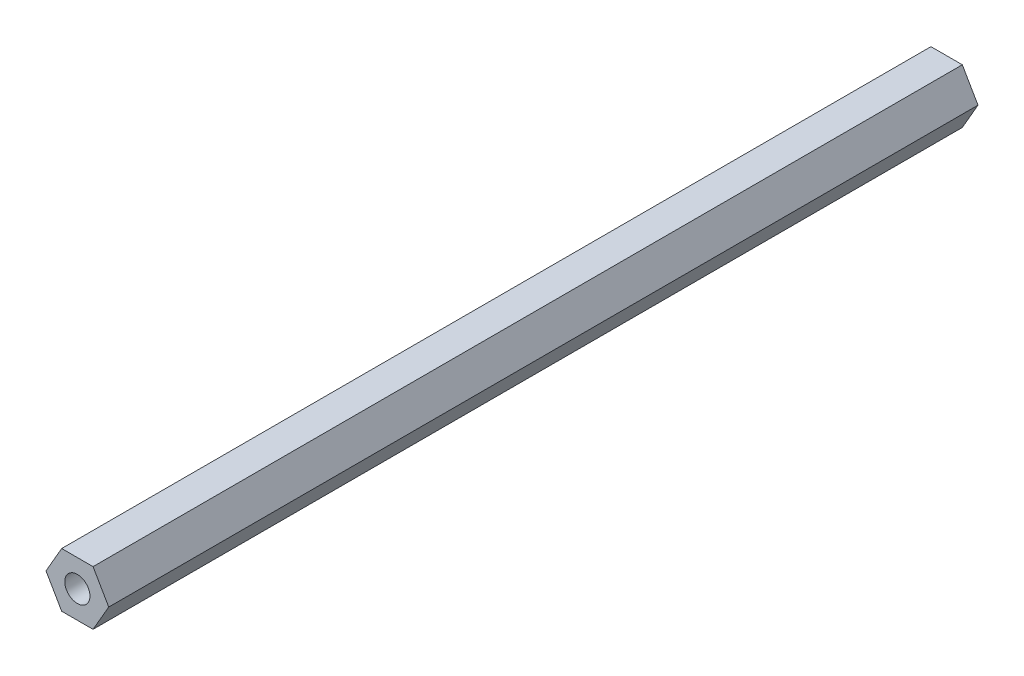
ISO-10303-21;
HEADER;
FILE_DESCRIPTION(('STEP AP214'),'2;1');
FILE_NAME('part.step','',(''),(''),'','','');
FILE_SCHEMA(('AUTOMOTIVE_DESIGN { 1 0 10303 214 1 1 1 1 }'));
ENDSEC;
DATA;
#1=APPLICATION_CONTEXT('core data for automotive mechanical design processes');
#2=APPLICATION_PROTOCOL_DEFINITION('international standard','automotive_design',2000,#1);
#3=PRODUCT_CONTEXT('',#1,'mechanical');
#4=PRODUCT('Part','Part','',(#3));
#5=PRODUCT_RELATED_PRODUCT_CATEGORY('part','',(#4));
#6=PRODUCT_DEFINITION_FORMATION('','',#4);
#7=PRODUCT_DEFINITION_CONTEXT('part definition',#1,'design');
#8=PRODUCT_DEFINITION('design','',#6,#7);
#9=PRODUCT_DEFINITION_SHAPE('','',#8);
#10=(LENGTH_UNIT() NAMED_UNIT(*) SI_UNIT(.MILLI.,.METRE.));
#11=(NAMED_UNIT(*) PLANE_ANGLE_UNIT() SI_UNIT($,.RADIAN.));
#12=(NAMED_UNIT(*) SI_UNIT($,.STERADIAN.) SOLID_ANGLE_UNIT());
#13=UNCERTAINTY_MEASURE_WITH_UNIT(LENGTH_MEASURE(1.E-05),#10,'distance_accuracy_value','');
#14=(GEOMETRIC_REPRESENTATION_CONTEXT(3) GLOBAL_UNCERTAINTY_ASSIGNED_CONTEXT((#13)) GLOBAL_UNIT_ASSIGNED_CONTEXT((#10,
#11,#12)) REPRESENTATION_CONTEXT('',''));
#15=CARTESIAN_POINT('',(0.,0.,0.));
#16=DIRECTION('',(0.,0.,1.));
#17=DIRECTION('',(1.,0.,0.));
#18=AXIS2_PLACEMENT_3D('',#15,#16,#17);
#19=CARTESIAN_POINT('',(3.66617420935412,0.,101.6));
#20=DIRECTION('',(-0.866025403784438,-0.5,0.));
#21=DIRECTION('',(0.5,-0.866025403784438,0.));
#22=AXIS2_PLACEMENT_3D('',#19,#20,#21);
#23=PLANE('',#22);
#24=DIRECTION('',(-0.5,0.866025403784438,0.));
#25=VECTOR('',#24,1.);
#26=CARTESIAN_POINT('',(3.66617420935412,0.,0.));
#27=LINE('',#26,#25);
#28=CARTESIAN_POINT('',(3.66617420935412,0.,0.));
#29=VERTEX_POINT('',#28);
#30=CARTESIAN_POINT('',(1.83308710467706,3.175,0.));
#31=VERTEX_POINT('',#30);
#32=EDGE_CURVE('E117',#29,#31,#27,.T.);
#33=ORIENTED_EDGE('',*,*,#32,.T.);
#34=DIRECTION('',(0.,0.,-1.));
#35=VECTOR('',#34,1.);
#36=CARTESIAN_POINT('',(1.83308710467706,3.175,101.6));
#37=LINE('',#36,#35);
#38=CARTESIAN_POINT('',(1.83308710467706,3.175,101.6));
#39=VERTEX_POINT('',#38);
#40=EDGE_CURVE('E11',#39,#31,#37,.T.);
#41=ORIENTED_EDGE('',*,*,#40,.F.);
#42=DIRECTION('',(-0.5,0.866025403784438,0.));
#43=VECTOR('',#42,1.);
#44=CARTESIAN_POINT('',(3.66617420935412,0.,101.6));
#45=LINE('',#44,#43);
#46=CARTESIAN_POINT('',(3.66617420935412,0.,101.6));
#47=VERTEX_POINT('',#46);
#48=EDGE_CURVE('E128',#47,#39,#45,.T.);
#49=ORIENTED_EDGE('',*,*,#48,.F.);
#50=DIRECTION('',(0.,0.,-1.));
#51=VECTOR('',#50,1.);
#52=CARTESIAN_POINT('',(3.66617420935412,0.,101.6));
#53=LINE('',#52,#51);
#54=EDGE_CURVE('E113',#47,#29,#53,.T.);
#55=ORIENTED_EDGE('',*,*,#54,.T.);
#56=EDGE_LOOP('',(#33,#41,#49,#55));
#57=FACE_BOUND('',#56,.T.);
#58=ADVANCED_FACE('F33',(#57),#23,.F.);
#59=CARTESIAN_POINT('',(1.83308710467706,3.175,101.6));
#60=DIRECTION('',(0.,-1.,0.));
#61=DIRECTION('',(0.,0.,-1.));
#62=AXIS2_PLACEMENT_3D('',#59,#60,#61);
#63=PLANE('',#62);
#64=DIRECTION('',(-1.,0.,0.));
#65=VECTOR('',#64,1.);
#66=CARTESIAN_POINT('',(1.83308710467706,3.175,0.));
#67=LINE('',#66,#65);
#68=CARTESIAN_POINT('',(-1.83308710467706,3.175,0.));
#69=VERTEX_POINT('',#68);
#70=EDGE_CURVE('E120',#31,#69,#67,.T.);
#71=ORIENTED_EDGE('',*,*,#70,.T.);
#72=DIRECTION('',(0.,0.,-1.));
#73=VECTOR('',#72,1.);
#74=CARTESIAN_POINT('',(-1.83308710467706,3.175,101.6));
#75=LINE('',#74,#73);
#76=CARTESIAN_POINT('',(-1.83308710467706,3.175,101.6));
#77=VERTEX_POINT('',#76);
#78=EDGE_CURVE('E41',#77,#69,#75,.T.);
#79=ORIENTED_EDGE('',*,*,#78,.F.);
#80=DIRECTION('',(-1.,0.,0.));
#81=VECTOR('',#80,1.);
#82=CARTESIAN_POINT('',(1.83308710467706,3.175,101.6));
#83=LINE('',#82,#81);
#84=EDGE_CURVE('E86',#39,#77,#83,.T.);
#85=ORIENTED_EDGE('',*,*,#84,.F.);
#86=ORIENTED_EDGE('',*,*,#40,.T.);
#87=EDGE_LOOP('',(#71,#79,#85,#86));
#88=FACE_BOUND('',#87,.T.);
#89=ADVANCED_FACE('F153',(#88),#63,.F.);
#90=CARTESIAN_POINT('',(-1.83308710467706,3.175,101.6));
#91=DIRECTION('',(0.866025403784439,-0.5,0.));
#92=DIRECTION('',(0.5,0.866025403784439,0.));
#93=AXIS2_PLACEMENT_3D('',#90,#91,#92);
#94=PLANE('',#93);
#95=DIRECTION('',(-0.5,-0.866025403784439,0.));
#96=VECTOR('',#95,1.);
#97=CARTESIAN_POINT('',(-1.83308710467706,3.175,0.));
#98=LINE('',#97,#96);
#99=CARTESIAN_POINT('',(-3.66617420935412,0.,0.));
#100=VERTEX_POINT('',#99);
#101=EDGE_CURVE('E123',#69,#100,#98,.T.);
#102=ORIENTED_EDGE('',*,*,#101,.T.);
#103=DIRECTION('',(0.,0.,-1.));
#104=VECTOR('',#103,1.);
#105=CARTESIAN_POINT('',(-3.66617420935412,0.,101.6));
#106=LINE('',#105,#104);
#107=CARTESIAN_POINT('',(-3.66617420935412,0.,101.6));
#108=VERTEX_POINT('',#107);
#109=EDGE_CURVE('E108',#108,#100,#106,.T.);
#110=ORIENTED_EDGE('',*,*,#109,.F.);
#111=DIRECTION('',(-0.5,-0.866025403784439,0.));
#112=VECTOR('',#111,1.);
#113=CARTESIAN_POINT('',(-1.83308710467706,3.175,101.6));
#114=LINE('',#113,#112);
#115=EDGE_CURVE('E99',#77,#108,#114,.T.);
#116=ORIENTED_EDGE('',*,*,#115,.F.);
#117=ORIENTED_EDGE('',*,*,#78,.T.);
#118=EDGE_LOOP('',(#102,#110,#116,#117));
#119=FACE_BOUND('',#118,.T.);
#120=ADVANCED_FACE('F134',(#119),#94,.F.);
#121=CARTESIAN_POINT('',(-3.66617420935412,0.,101.6));
#122=DIRECTION('',(0.866025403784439,0.5,0.));
#123=DIRECTION('',(-0.5,0.866025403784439,0.));
#124=AXIS2_PLACEMENT_3D('',#121,#122,#123);
#125=PLANE('',#124);
#126=DIRECTION('',(0.5,-0.866025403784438,0.));
#127=VECTOR('',#126,1.);
#128=CARTESIAN_POINT('',(-3.66617420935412,0.,0.));
#129=LINE('',#128,#127);
#130=CARTESIAN_POINT('',(-1.83308710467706,-3.175,0.));
#131=VERTEX_POINT('',#130);
#132=EDGE_CURVE('E107',#100,#131,#129,.T.);
#133=ORIENTED_EDGE('',*,*,#132,.T.);
#134=DIRECTION('',(0.,0.,-1.));
#135=VECTOR('',#134,1.);
#136=CARTESIAN_POINT('',(-1.83308710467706,-3.175,101.6));
#137=LINE('',#136,#135);
#138=CARTESIAN_POINT('',(-1.83308710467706,-3.175,101.6));
#139=VERTEX_POINT('',#138);
#140=EDGE_CURVE('E104',#139,#131,#137,.T.);
#141=ORIENTED_EDGE('',*,*,#140,.F.);
#142=DIRECTION('',(0.5,-0.866025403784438,0.));
#143=VECTOR('',#142,1.);
#144=CARTESIAN_POINT('',(-3.66617420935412,0.,101.6));
#145=LINE('',#144,#143);
#146=EDGE_CURVE('E93',#108,#139,#145,.T.);
#147=ORIENTED_EDGE('',*,*,#146,.F.);
#148=ORIENTED_EDGE('',*,*,#109,.T.);
#149=EDGE_LOOP('',(#133,#141,#147,#148));
#150=FACE_BOUND('',#149,.T.);
#151=ADVANCED_FACE('F105',(#150),#125,.F.);
#152=CARTESIAN_POINT('',(-1.83308710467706,-3.175,101.6));
#153=DIRECTION('',(0.,1.,0.));
#154=DIRECTION('',(-1.,0.,0.));
#155=AXIS2_PLACEMENT_3D('',#152,#153,#154);
#156=PLANE('',#155);
#157=DIRECTION('',(1.,0.,0.));
#158=VECTOR('',#157,1.);
#159=CARTESIAN_POINT('',(-1.83308710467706,-3.175,0.));
#160=LINE('',#159,#158);
#161=CARTESIAN_POINT('',(1.83308710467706,-3.175,0.));
#162=VERTEX_POINT('',#161);
#163=EDGE_CURVE('E72',#131,#162,#160,.T.);
#164=ORIENTED_EDGE('',*,*,#163,.T.);
#165=DIRECTION('',(0.,0.,-1.));
#166=VECTOR('',#165,1.);
#167=CARTESIAN_POINT('',(1.83308710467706,-3.175,101.6));
#168=LINE('',#167,#166);
#169=CARTESIAN_POINT('',(1.83308710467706,-3.175,101.6));
#170=VERTEX_POINT('',#169);
#171=EDGE_CURVE('E109',#170,#162,#168,.T.);
#172=ORIENTED_EDGE('',*,*,#171,.F.);
#173=DIRECTION('',(1.,0.,0.));
#174=VECTOR('',#173,1.);
#175=CARTESIAN_POINT('',(-1.83308710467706,-3.175,101.6));
#176=LINE('',#175,#174);
#177=EDGE_CURVE('E97',#139,#170,#176,.T.);
#178=ORIENTED_EDGE('',*,*,#177,.F.);
#179=ORIENTED_EDGE('',*,*,#140,.T.);
#180=EDGE_LOOP('',(#164,#172,#178,#179));
#181=FACE_BOUND('',#180,.T.);
#182=ADVANCED_FACE('F111',(#181),#156,.F.);
#183=CARTESIAN_POINT('',(1.83308710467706,-3.175,101.6));
#184=DIRECTION('',(-0.866025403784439,0.5,0.));
#185=DIRECTION('',(-0.5,-0.866025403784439,0.));
#186=AXIS2_PLACEMENT_3D('',#183,#184,#185);
#187=PLANE('',#186);
#188=DIRECTION('',(0.5,0.866025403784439,0.));
#189=VECTOR('',#188,1.);
#190=CARTESIAN_POINT('',(1.83308710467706,-3.175,0.));
#191=LINE('',#190,#189);
#192=EDGE_CURVE('E78',#162,#29,#191,.T.);
#193=ORIENTED_EDGE('',*,*,#192,.T.);
#194=ORIENTED_EDGE('',*,*,#54,.F.);
#195=DIRECTION('',(0.5,0.866025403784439,0.));
#196=VECTOR('',#195,1.);
#197=CARTESIAN_POINT('',(1.83308710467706,-3.175,101.6));
#198=LINE('',#197,#196);
#199=EDGE_CURVE('E49',#170,#47,#198,.T.);
#200=ORIENTED_EDGE('',*,*,#199,.F.);
#201=ORIENTED_EDGE('',*,*,#171,.T.);
#202=EDGE_LOOP('',(#193,#194,#200,#201));
#203=FACE_BOUND('',#202,.T.);
#204=ADVANCED_FACE('F141',(#203),#187,.F.);
#205=CARTESIAN_POINT('',(0.,0.,101.6));
#206=DIRECTION('',(0.,0.,1.));
#207=DIRECTION('',(1.,0.,0.));
#208=AXIS2_PLACEMENT_3D('',#205,#206,#207);
#209=PLANE('',#208);
#210=CARTESIAN_POINT('',(0.,0.,101.6));
#211=DIRECTION('',(0.,0.,1.));
#212=DIRECTION('',(1.,0.,0.));
#213=AXIS2_PLACEMENT_3D('',#210,#211,#212);
#214=CIRCLE('',#213,1.47319999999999);
#215=CARTESIAN_POINT('',(1.47319999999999,0.,101.6));
#216=VERTEX_POINT('',#215);
#217=EDGE_CURVE('E208',#216,#216,#214,.T.);
#218=ORIENTED_EDGE('',*,*,#217,.F.);
#219=EDGE_LOOP('',(#218));
#220=FACE_BOUND('',#219,.T.);
#221=ORIENTED_EDGE('',*,*,#48,.T.);
#222=ORIENTED_EDGE('',*,*,#84,.T.);
#223=ORIENTED_EDGE('',*,*,#115,.T.);
#224=ORIENTED_EDGE('',*,*,#146,.T.);
#225=ORIENTED_EDGE('',*,*,#177,.T.);
#226=ORIENTED_EDGE('',*,*,#199,.T.);
#227=EDGE_LOOP('',(#221,#222,#223,#224,#225,#226));
#228=FACE_BOUND('',#227,.T.);
#229=ADVANCED_FACE('F95',(#220,#228),#209,.T.);
#230=CARTESIAN_POINT('',(0.,0.,0.));
#231=DIRECTION('',(0.,0.,1.));
#232=DIRECTION('',(1.,0.,0.));
#233=AXIS2_PLACEMENT_3D('',#230,#231,#232);
#234=PLANE('',#233);
#235=CARTESIAN_POINT('',(0.,0.,0.));
#236=DIRECTION('',(0.,0.,1.));
#237=DIRECTION('',(1.,0.,0.));
#238=AXIS2_PLACEMENT_3D('',#235,#236,#237);
#239=CIRCLE('',#238,1.47319999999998);
#240=CARTESIAN_POINT('',(1.47319999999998,0.,0.));
#241=VERTEX_POINT('',#240);
#242=EDGE_CURVE('E121',#241,#241,#239,.T.);
#243=ORIENTED_EDGE('',*,*,#242,.T.);
#244=EDGE_LOOP('',(#243));
#245=FACE_BOUND('',#244,.T.);
#246=ORIENTED_EDGE('',*,*,#32,.F.);
#247=ORIENTED_EDGE('',*,*,#192,.F.);
#248=ORIENTED_EDGE('',*,*,#163,.F.);
#249=ORIENTED_EDGE('',*,*,#132,.F.);
#250=ORIENTED_EDGE('',*,*,#101,.F.);
#251=ORIENTED_EDGE('',*,*,#70,.F.);
#252=EDGE_LOOP('',(#246,#247,#248,#249,#250,#251));
#253=FACE_BOUND('',#252,.T.);
#254=ADVANCED_FACE('F137',(#245,#253),#234,.F.);
#255=CARTESIAN_POINT('',(0.,0.,101.6));
#256=DIRECTION('',(0.,0.,1.));
#257=DIRECTION('',(1.,0.,0.));
#258=AXIS2_PLACEMENT_3D('',#255,#256,#257);
#259=CYLINDRICAL_SURFACE('',#258,1.47319999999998);
#260=ORIENTED_EDGE('',*,*,#242,.F.);
#261=EDGE_LOOP('',(#260));
#262=FACE_BOUND('',#261,.T.);
#263=ORIENTED_EDGE('',*,*,#217,.T.);
#264=EDGE_LOOP('',(#263));
#265=FACE_BOUND('',#264,.T.);
#266=ADVANCED_FACE('F190',(#262,#265),#259,.F.);
#267=CLOSED_SHELL('',(#58,#89,#120,#151,#182,#204,#229,#254,#266));
#268=MANIFOLD_SOLID_BREP('B2',#267);
#269=ADVANCED_BREP_SHAPE_REPRESENTATION('',(#18,#268),#14);
#270=SHAPE_DEFINITION_REPRESENTATION(#9,#269);
ENDSEC;
END-ISO-10303-21;
